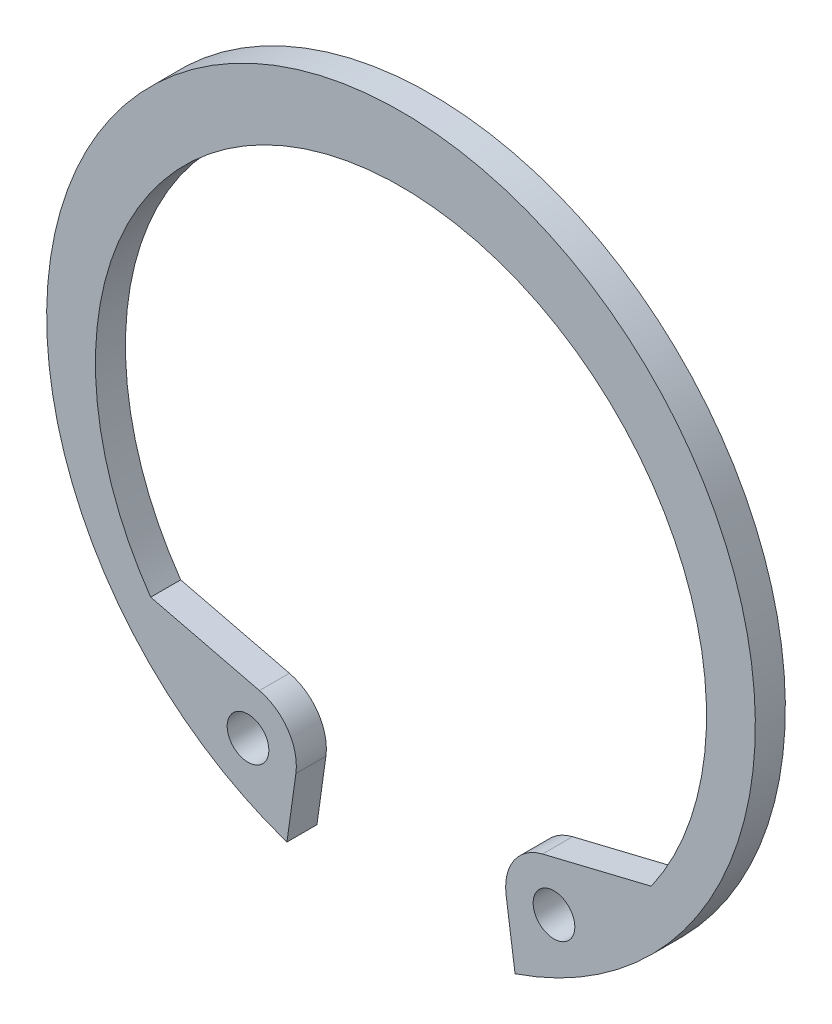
ISO-10303-21;
HEADER;
FILE_DESCRIPTION(('STEP AP214'),'2;1');
FILE_NAME('part.step','',(''),(''),'','','');
FILE_SCHEMA(('AUTOMOTIVE_DESIGN { 1 0 10303 214 1 1 1 1 }'));
ENDSEC;
DATA;
#1=APPLICATION_CONTEXT('core data for automotive mechanical design processes');
#2=APPLICATION_PROTOCOL_DEFINITION('international standard','automotive_design',2000,#1);
#3=PRODUCT_CONTEXT('',#1,'mechanical');
#4=PRODUCT('Part','Part','',(#3));
#5=PRODUCT_RELATED_PRODUCT_CATEGORY('part','',(#4));
#6=PRODUCT_DEFINITION_FORMATION('','',#4);
#7=PRODUCT_DEFINITION_CONTEXT('part definition',#1,'design');
#8=PRODUCT_DEFINITION('design','',#6,#7);
#9=PRODUCT_DEFINITION_SHAPE('','',#8);
#10=(LENGTH_UNIT() NAMED_UNIT(*) SI_UNIT(.MILLI.,.METRE.));
#11=(NAMED_UNIT(*) PLANE_ANGLE_UNIT() SI_UNIT($,.RADIAN.));
#12=(NAMED_UNIT(*) SI_UNIT($,.STERADIAN.) SOLID_ANGLE_UNIT());
#13=UNCERTAINTY_MEASURE_WITH_UNIT(LENGTH_MEASURE(1.E-05),#10,'distance_accuracy_value','');
#14=(GEOMETRIC_REPRESENTATION_CONTEXT(3) GLOBAL_UNCERTAINTY_ASSIGNED_CONTEXT((#13)) GLOBAL_UNIT_ASSIGNED_CONTEXT((#10,
#11,#12)) REPRESENTATION_CONTEXT('',''));
#15=CARTESIAN_POINT('',(0.,0.,0.));
#16=DIRECTION('',(0.,0.,1.));
#17=DIRECTION('',(1.,0.,0.));
#18=AXIS2_PLACEMENT_3D('',#15,#16,#17);
#19=CARTESIAN_POINT('',(0.,-0.228093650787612,1.8));
#20=DIRECTION('',(0.,0.,1.));
#21=DIRECTION('',(1.,0.,0.));
#22=AXIS2_PLACEMENT_3D('',#19,#20,#21);
#23=PLANE('',#22);
#24=CARTESIAN_POINT('',(-9.175,-15.8915661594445,1.8));
#25=DIRECTION('',(0.,0.,1.));
#26=DIRECTION('',(1.,0.,0.));
#27=AXIS2_PLACEMENT_3D('',#24,#25,#26);
#28=CIRCLE('',#27,1.25);
#29=CARTESIAN_POINT('',(-7.925,-15.8915661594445,1.8));
#30=VERTEX_POINT('',#29);
#31=EDGE_CURVE('E114',#30,#30,#28,.F.);
#32=ORIENTED_EDGE('',*,*,#31,.T.);
#33=EDGE_LOOP('',(#32));
#34=FACE_BOUND('',#33,.T.);
#35=CARTESIAN_POINT('',(9.175,-15.8915661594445,1.8));
#36=DIRECTION('',(0.,0.,1.));
#37=DIRECTION('',(1.,0.,0.));
#38=AXIS2_PLACEMENT_3D('',#35,#36,#37);
#39=CIRCLE('',#38,1.25);
#40=CARTESIAN_POINT('',(10.425,-15.8915661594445,1.8));
#41=VERTEX_POINT('',#40);
#42=EDGE_CURVE('E118',#41,#41,#39,.F.);
#43=ORIENTED_EDGE('',*,*,#42,.T.);
#44=EDGE_LOOP('',(#43));
#45=FACE_BOUND('',#44,.T.);
#46=DIRECTION('',(0.139173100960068,0.99026806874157,0.));
#47=VECTOR('',#46,1.);
#48=CARTESIAN_POINT('',(-6.30322260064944,-16.2951681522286,1.8));
#49=LINE('',#48,#47);
#50=CARTESIAN_POINT('',(-6.30322260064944,-16.2951681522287,1.8));
#51=VERTEX_POINT('',#50);
#52=CARTESIAN_POINT('',(-6.8406076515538,-20.1188614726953,1.8));
#53=VERTEX_POINT('',#52);
#54=EDGE_CURVE('E124',#51,#53,#49,.F.);
#55=ORIENTED_EDGE('',*,*,#54,.F.);
#56=CARTESIAN_POINT('',(-9.175,-15.8915661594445,1.8));
#57=DIRECTION('',(0.,0.,1.));
#58=DIRECTION('',(1.,0.,0.));
#59=AXIS2_PLACEMENT_3D('',#56,#57,#58);
#60=CIRCLE('',#59,2.9);
#61=CARTESIAN_POINT('',(-8.48890326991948,-13.0738949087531,1.8));
#62=VERTEX_POINT('',#61);
#63=EDGE_CURVE('E94',#62,#51,#60,.F.);
#64=ORIENTED_EDGE('',*,*,#63,.F.);
#65=DIRECTION('',(-0.971610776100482,0.236585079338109,0.));
#66=VECTOR('',#65,1.);
#67=CARTESIAN_POINT('',(-15.0109612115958,-11.4857881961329,1.8));
#68=LINE('',#67,#66);
#69=CARTESIAN_POINT('',(-15.0109612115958,-11.4857881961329,1.8));
#70=VERTEX_POINT('',#69);
#71=EDGE_CURVE('E123',#70,#62,#68,.F.);
#72=ORIENTED_EDGE('',*,*,#71,.F.);
#73=CARTESIAN_POINT('',(0.,-0.975,1.8));
#74=DIRECTION('',(0.,0.,1.));
#75=DIRECTION('',(1.,0.,0.));
#76=AXIS2_PLACEMENT_3D('',#73,#74,#75);
#77=CIRCLE('',#76,18.325);
#78=CARTESIAN_POINT('',(15.0109612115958,-11.4857881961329,1.8));
#79=VERTEX_POINT('',#78);
#80=EDGE_CURVE('E119',#70,#79,#77,.F.);
#81=ORIENTED_EDGE('',*,*,#80,.T.);
#82=DIRECTION('',(-0.971610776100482,-0.236585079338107,0.));
#83=VECTOR('',#82,1.);
#84=CARTESIAN_POINT('',(8.48890326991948,-13.073894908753,1.8));
#85=LINE('',#84,#83);
#86=CARTESIAN_POINT('',(8.48890326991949,-13.073894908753,1.8));
#87=VERTEX_POINT('',#86);
#88=EDGE_CURVE('E135',#87,#79,#85,.F.);
#89=ORIENTED_EDGE('',*,*,#88,.F.);
#90=CARTESIAN_POINT('',(9.175,-15.8915661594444,1.8));
#91=DIRECTION('',(0.,0.,1.));
#92=DIRECTION('',(1.,0.,0.));
#93=AXIS2_PLACEMENT_3D('',#90,#91,#92);
#94=CIRCLE('',#93,2.9);
#95=CARTESIAN_POINT('',(6.30322260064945,-16.2951681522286,1.8));
#96=VERTEX_POINT('',#95);
#97=EDGE_CURVE('E20',#96,#87,#94,.F.);
#98=ORIENTED_EDGE('',*,*,#97,.F.);
#99=DIRECTION('',(0.139173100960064,-0.99026806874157,0.));
#100=VECTOR('',#99,1.);
#101=CARTESIAN_POINT('',(6.84060765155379,-20.1188614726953,1.8));
#102=LINE('',#101,#100);
#103=CARTESIAN_POINT('',(6.84060765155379,-20.1188614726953,1.8));
#104=VERTEX_POINT('',#103);
#105=EDGE_CURVE('E132',#104,#96,#102,.F.);
#106=ORIENTED_EDGE('',*,*,#105,.F.);
#107=CARTESIAN_POINT('',(0.,0.,1.8));
#108=DIRECTION('',(0.,0.,1.));
#109=DIRECTION('',(1.,0.,0.));
#110=AXIS2_PLACEMENT_3D('',#107,#108,#109);
#111=CIRCLE('',#110,21.25);
#112=EDGE_CURVE('E128',#53,#104,#111,.F.);
#113=ORIENTED_EDGE('',*,*,#112,.F.);
#114=EDGE_LOOP('',(#55,#64,#72,#81,#89,#98,#106,#113));
#115=FACE_BOUND('',#114,.T.);
#116=ADVANCED_FACE('F16',(#34,#45,#115),#23,.T.);
#117=CARTESIAN_POINT('',(8.48890326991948,-13.073894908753,0.));
#118=DIRECTION('',(-0.236585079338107,0.971610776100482,0.));
#119=DIRECTION('',(-0.971610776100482,-0.236585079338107,0.));
#120=AXIS2_PLACEMENT_3D('',#117,#118,#119);
#121=PLANE('',#120);
#122=DIRECTION('',(-0.971610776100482,-0.236585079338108,0.));
#123=VECTOR('',#122,1.);
#124=CARTESIAN_POINT('',(15.0109612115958,-11.4857881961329,0.));
#125=LINE('',#124,#123);
#126=CARTESIAN_POINT('',(15.0109612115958,-11.4857881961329,0.));
#127=VERTEX_POINT('',#126);
#128=CARTESIAN_POINT('',(8.48890326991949,-13.073894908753,0.));
#129=VERTEX_POINT('',#128);
#130=EDGE_CURVE('E111',#127,#129,#125,.T.);
#131=ORIENTED_EDGE('',*,*,#130,.T.);
#132=DIRECTION('',(0.,0.,1.));
#133=VECTOR('',#132,1.);
#134=CARTESIAN_POINT('',(8.48890326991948,-13.0738949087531,0.));
#135=LINE('',#134,#133);
#136=EDGE_CURVE('E133',#87,#129,#135,.F.);
#137=ORIENTED_EDGE('',*,*,#136,.F.);
#138=ORIENTED_EDGE('',*,*,#88,.T.);
#139=DIRECTION('',(0.,0.,1.));
#140=VECTOR('',#139,1.);
#141=CARTESIAN_POINT('',(15.0109612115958,-11.4857881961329,0.));
#142=LINE('',#141,#140);
#143=EDGE_CURVE('E115',#79,#127,#142,.F.);
#144=ORIENTED_EDGE('',*,*,#143,.T.);
#145=EDGE_LOOP('',(#131,#137,#138,#144));
#146=FACE_BOUND('',#145,.T.);
#147=ADVANCED_FACE('F169',(#146),#121,.T.);
#148=CARTESIAN_POINT('',(9.175,-15.8915661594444,0.));
#149=DIRECTION('',(0.,0.,1.));
#150=DIRECTION('',(1.,0.,0.));
#151=AXIS2_PLACEMENT_3D('',#148,#149,#150);
#152=CYLINDRICAL_SURFACE('',#151,2.9);
#153=ORIENTED_EDGE('',*,*,#136,.T.);
#154=CARTESIAN_POINT('',(9.175,-15.8915661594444,0.));
#155=DIRECTION('',(0.,0.,1.));
#156=DIRECTION('',(1.,0.,0.));
#157=AXIS2_PLACEMENT_3D('',#154,#155,#156);
#158=CIRCLE('',#157,2.9);
#159=CARTESIAN_POINT('',(6.30322260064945,-16.2951681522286,0.));
#160=VERTEX_POINT('',#159);
#161=EDGE_CURVE('E110',#129,#160,#158,.T.);
#162=ORIENTED_EDGE('',*,*,#161,.T.);
#163=DIRECTION('',(0.,0.,1.));
#164=VECTOR('',#163,1.);
#165=CARTESIAN_POINT('',(6.30322260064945,-16.2951681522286,0.));
#166=LINE('',#165,#164);
#167=EDGE_CURVE('E129',#96,#160,#166,.F.);
#168=ORIENTED_EDGE('',*,*,#167,.F.);
#169=ORIENTED_EDGE('',*,*,#97,.T.);
#170=EDGE_LOOP('',(#153,#162,#168,#169));
#171=FACE_BOUND('',#170,.T.);
#172=ADVANCED_FACE('F166',(#171),#152,.T.);
#173=CARTESIAN_POINT('',(6.84060765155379,-20.1188614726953,0.));
#174=DIRECTION('',(-0.99026806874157,-0.139173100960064,0.));
#175=DIRECTION('',(0.139173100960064,-0.99026806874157,0.));
#176=AXIS2_PLACEMENT_3D('',#173,#174,#175);
#177=PLANE('',#176);
#178=DIRECTION('',(0.139173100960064,-0.990268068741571,0.));
#179=VECTOR('',#178,1.);
#180=CARTESIAN_POINT('',(6.30322260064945,-16.2951681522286,0.));
#181=LINE('',#180,#179);
#182=CARTESIAN_POINT('',(6.84060765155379,-20.1188614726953,0.));
#183=VERTEX_POINT('',#182);
#184=EDGE_CURVE('E104',#160,#183,#181,.T.);
#185=ORIENTED_EDGE('',*,*,#184,.T.);
#186=DIRECTION('',(0.,0.,1.));
#187=VECTOR('',#186,1.);
#188=CARTESIAN_POINT('',(6.84060765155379,-20.1188614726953,0.));
#189=LINE('',#188,#187);
#190=EDGE_CURVE('E126',#104,#183,#189,.F.);
#191=ORIENTED_EDGE('',*,*,#190,.F.);
#192=ORIENTED_EDGE('',*,*,#105,.T.);
#193=ORIENTED_EDGE('',*,*,#167,.T.);
#194=EDGE_LOOP('',(#185,#191,#192,#193));
#195=FACE_BOUND('',#194,.T.);
#196=ADVANCED_FACE('F162',(#195),#177,.T.);
#197=CARTESIAN_POINT('',(0.,0.,0.));
#198=DIRECTION('',(0.,0.,1.));
#199=DIRECTION('',(1.,0.,0.));
#200=AXIS2_PLACEMENT_3D('',#197,#198,#199);
#201=CYLINDRICAL_SURFACE('',#200,21.25);
#202=DIRECTION('',(0.,0.,1.));
#203=VECTOR('',#202,1.);
#204=CARTESIAN_POINT('',(-6.8406076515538,-20.1188614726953,0.));
#205=LINE('',#204,#203);
#206=CARTESIAN_POINT('',(-6.8406076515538,-20.1188614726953,0.));
#207=VERTEX_POINT('',#206);
#208=EDGE_CURVE('E97',#53,#207,#205,.F.);
#209=ORIENTED_EDGE('',*,*,#208,.F.);
#210=ORIENTED_EDGE('',*,*,#112,.T.);
#211=ORIENTED_EDGE('',*,*,#190,.T.);
#212=CARTESIAN_POINT('',(0.,0.,0.));
#213=DIRECTION('',(0.,0.,1.));
#214=DIRECTION('',(1.,0.,0.));
#215=AXIS2_PLACEMENT_3D('',#212,#213,#214);
#216=CIRCLE('',#215,21.25);
#217=EDGE_CURVE('E102',#183,#207,#216,.T.);
#218=ORIENTED_EDGE('',*,*,#217,.T.);
#219=EDGE_LOOP('',(#209,#210,#211,#218));
#220=FACE_BOUND('',#219,.T.);
#221=ADVANCED_FACE('F156',(#220),#201,.T.);
#222=CARTESIAN_POINT('',(-6.30322260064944,-16.2951681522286,0.));
#223=DIRECTION('',(0.99026806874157,-0.139173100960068,0.));
#224=DIRECTION('',(0.139173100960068,0.99026806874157,0.));
#225=AXIS2_PLACEMENT_3D('',#222,#223,#224);
#226=PLANE('',#225);
#227=DIRECTION('',(0.139173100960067,0.99026806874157,0.));
#228=VECTOR('',#227,1.);
#229=CARTESIAN_POINT('',(-6.84060765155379,-20.1188614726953,0.));
#230=LINE('',#229,#228);
#231=CARTESIAN_POINT('',(-6.30322260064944,-16.2951681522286,0.));
#232=VERTEX_POINT('',#231);
#233=EDGE_CURVE('E84',#207,#232,#230,.T.);
#234=ORIENTED_EDGE('',*,*,#233,.T.);
#235=DIRECTION('',(0.,0.,1.));
#236=VECTOR('',#235,1.);
#237=CARTESIAN_POINT('',(-6.30322260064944,-16.2951681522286,0.));
#238=LINE('',#237,#236);
#239=EDGE_CURVE('E91',#232,#51,#238,.T.);
#240=ORIENTED_EDGE('',*,*,#239,.T.);
#241=ORIENTED_EDGE('',*,*,#54,.T.);
#242=ORIENTED_EDGE('',*,*,#208,.T.);
#243=EDGE_LOOP('',(#234,#240,#241,#242));
#244=FACE_BOUND('',#243,.T.);
#245=ADVANCED_FACE('F100',(#244),#226,.T.);
#246=CARTESIAN_POINT('',(-9.175,-15.8915661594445,0.));
#247=DIRECTION('',(0.,0.,1.));
#248=DIRECTION('',(1.,0.,0.));
#249=AXIS2_PLACEMENT_3D('',#246,#247,#248);
#250=CYLINDRICAL_SURFACE('',#249,2.9);
#251=DIRECTION('',(0.,0.,1.));
#252=VECTOR('',#251,1.);
#253=CARTESIAN_POINT('',(-8.48890326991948,-13.0738949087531,0.));
#254=LINE('',#253,#252);
#255=CARTESIAN_POINT('',(-8.48890326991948,-13.0738949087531,0.));
#256=VERTEX_POINT('',#255);
#257=EDGE_CURVE('E121',#62,#256,#254,.F.);
#258=ORIENTED_EDGE('',*,*,#257,.F.);
#259=ORIENTED_EDGE('',*,*,#63,.T.);
#260=ORIENTED_EDGE('',*,*,#239,.F.);
#261=CARTESIAN_POINT('',(-9.175,-15.8915661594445,0.));
#262=DIRECTION('',(0.,0.,1.));
#263=DIRECTION('',(1.,0.,0.));
#264=AXIS2_PLACEMENT_3D('',#261,#262,#263);
#265=CIRCLE('',#264,2.9);
#266=EDGE_CURVE('E79',#232,#256,#265,.T.);
#267=ORIENTED_EDGE('',*,*,#266,.T.);
#268=EDGE_LOOP('',(#258,#259,#260,#267));
#269=FACE_BOUND('',#268,.T.);
#270=ADVANCED_FACE('F92',(#269),#250,.T.);
#271=CARTESIAN_POINT('',(-15.0109612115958,-11.4857881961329,0.));
#272=DIRECTION('',(0.236585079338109,0.971610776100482,0.));
#273=DIRECTION('',(-0.971610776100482,0.236585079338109,0.));
#274=AXIS2_PLACEMENT_3D('',#271,#272,#273);
#275=PLANE('',#274);
#276=DIRECTION('',(-0.971610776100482,0.23658507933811,0.));
#277=VECTOR('',#276,1.);
#278=CARTESIAN_POINT('',(-8.48890326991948,-13.0738949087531,0.));
#279=LINE('',#278,#277);
#280=CARTESIAN_POINT('',(-15.0109612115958,-11.4857881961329,0.));
#281=VERTEX_POINT('',#280);
#282=EDGE_CURVE('E86',#256,#281,#279,.T.);
#283=ORIENTED_EDGE('',*,*,#282,.T.);
#284=DIRECTION('',(0.,0.,1.));
#285=VECTOR('',#284,1.);
#286=CARTESIAN_POINT('',(-15.0109612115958,-11.4857881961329,0.));
#287=LINE('',#286,#285);
#288=EDGE_CURVE('E35',#281,#70,#287,.T.);
#289=ORIENTED_EDGE('',*,*,#288,.T.);
#290=ORIENTED_EDGE('',*,*,#71,.T.);
#291=ORIENTED_EDGE('',*,*,#257,.T.);
#292=EDGE_LOOP('',(#283,#289,#290,#291));
#293=FACE_BOUND('',#292,.T.);
#294=ADVANCED_FACE('F174',(#293),#275,.T.);
#295=CARTESIAN_POINT('',(0.,-0.975,0.));
#296=DIRECTION('',(0.,0.,1.));
#297=DIRECTION('',(1.,0.,0.));
#298=AXIS2_PLACEMENT_3D('',#295,#296,#297);
#299=CYLINDRICAL_SURFACE('',#298,18.325);
#300=CARTESIAN_POINT('',(0.,-0.975,0.));
#301=DIRECTION('',(0.,0.,1.));
#302=DIRECTION('',(1.,0.,0.));
#303=AXIS2_PLACEMENT_3D('',#300,#301,#302);
#304=CIRCLE('',#303,18.325);
#305=EDGE_CURVE('E143',#281,#127,#304,.F.);
#306=ORIENTED_EDGE('',*,*,#305,.T.);
#307=ORIENTED_EDGE('',*,*,#143,.F.);
#308=ORIENTED_EDGE('',*,*,#80,.F.);
#309=ORIENTED_EDGE('',*,*,#288,.F.);
#310=EDGE_LOOP('',(#306,#307,#308,#309));
#311=FACE_BOUND('',#310,.T.);
#312=ADVANCED_FACE('F171',(#311),#299,.F.);
#313=CARTESIAN_POINT('',(9.175,-15.8915661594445,0.9));
#314=DIRECTION('',(0.,0.,1.));
#315=DIRECTION('',(1.,0.,0.));
#316=AXIS2_PLACEMENT_3D('',#313,#314,#315);
#317=CYLINDRICAL_SURFACE('',#316,1.25);
#318=ORIENTED_EDGE('',*,*,#42,.F.);
#319=EDGE_LOOP('',(#318));
#320=FACE_BOUND('',#319,.T.);
#321=CARTESIAN_POINT('',(9.175,-15.8915661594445,0.));
#322=DIRECTION('',(0.,0.,1.));
#323=DIRECTION('',(1.,0.,0.));
#324=AXIS2_PLACEMENT_3D('',#321,#322,#323);
#325=CIRCLE('',#324,1.25);
#326=CARTESIAN_POINT('',(10.425,-15.8915661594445,0.));
#327=VERTEX_POINT('',#326);
#328=EDGE_CURVE('E26',#327,#327,#325,.F.);
#329=ORIENTED_EDGE('',*,*,#328,.T.);
#330=EDGE_LOOP('',(#329));
#331=FACE_BOUND('',#330,.T.);
#332=ADVANCED_FACE('F180',(#320,#331),#317,.F.);
#333=CARTESIAN_POINT('',(-9.175,-15.8915661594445,0.9));
#334=DIRECTION('',(0.,0.,1.));
#335=DIRECTION('',(1.,0.,0.));
#336=AXIS2_PLACEMENT_3D('',#333,#334,#335);
#337=CYLINDRICAL_SURFACE('',#336,1.25);
#338=ORIENTED_EDGE('',*,*,#31,.F.);
#339=EDGE_LOOP('',(#338));
#340=FACE_BOUND('',#339,.T.);
#341=CARTESIAN_POINT('',(-9.175,-15.8915661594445,0.));
#342=DIRECTION('',(0.,0.,1.));
#343=DIRECTION('',(1.,0.,0.));
#344=AXIS2_PLACEMENT_3D('',#341,#342,#343);
#345=CIRCLE('',#344,1.25);
#346=CARTESIAN_POINT('',(-7.925,-15.8915661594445,0.));
#347=VERTEX_POINT('',#346);
#348=EDGE_CURVE('E10',#347,#347,#345,.F.);
#349=ORIENTED_EDGE('',*,*,#348,.T.);
#350=EDGE_LOOP('',(#349));
#351=FACE_BOUND('',#350,.T.);
#352=ADVANCED_FACE('F185',(#340,#351),#337,.F.);
#353=CARTESIAN_POINT('',(0.,-0.228093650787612,0.));
#354=DIRECTION('',(0.,0.,1.));
#355=DIRECTION('',(1.,0.,0.));
#356=AXIS2_PLACEMENT_3D('',#353,#354,#355);
#357=PLANE('',#356);
#358=ORIENTED_EDGE('',*,*,#348,.F.);
#359=EDGE_LOOP('',(#358));
#360=FACE_BOUND('',#359,.T.);
#361=ORIENTED_EDGE('',*,*,#328,.F.);
#362=EDGE_LOOP('',(#361));
#363=FACE_BOUND('',#362,.T.);
#364=ORIENTED_EDGE('',*,*,#130,.F.);
#365=ORIENTED_EDGE('',*,*,#305,.F.);
#366=ORIENTED_EDGE('',*,*,#282,.F.);
#367=ORIENTED_EDGE('',*,*,#266,.F.);
#368=ORIENTED_EDGE('',*,*,#233,.F.);
#369=ORIENTED_EDGE('',*,*,#217,.F.);
#370=ORIENTED_EDGE('',*,*,#184,.F.);
#371=ORIENTED_EDGE('',*,*,#161,.F.);
#372=EDGE_LOOP('',(#364,#365,#366,#367,#368,#369,#370,#371));
#373=FACE_BOUND('',#372,.T.);
#374=ADVANCED_FACE('F18',(#360,#363,#373),#357,.F.);
#375=CLOSED_SHELL('',(#116,#147,#172,#196,#221,#245,#270,#294,#312,#332,#352,#374));
#376=MANIFOLD_SOLID_BREP('B1',#375);
#377=ADVANCED_BREP_SHAPE_REPRESENTATION('',(#18,#376),#14);
#378=SHAPE_DEFINITION_REPRESENTATION(#9,#377);
ENDSEC;
END-ISO-10303-21;
